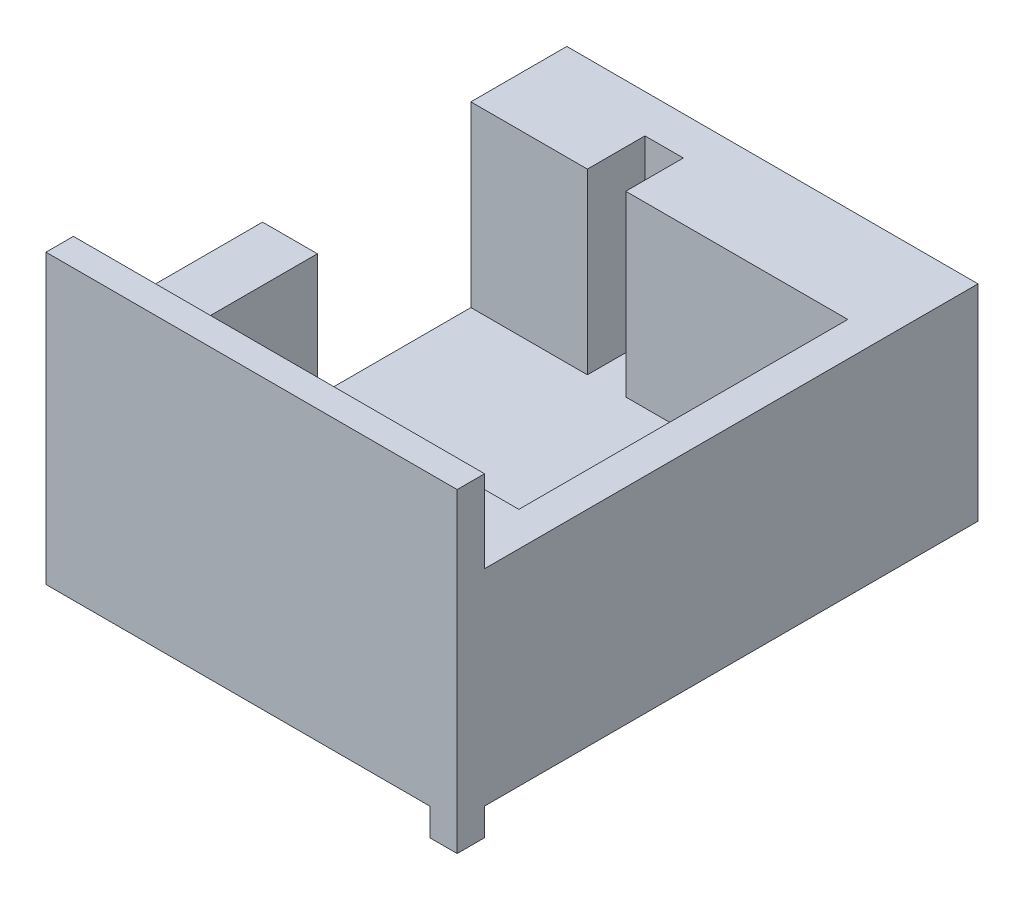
from build123d import *

# Parameters (mm, degrees)
SKETCH_1_W          = 30
SKETCH_1_H          = 38
EXTRUDE_1_DEPTH     = 15
CUT_EXTRUDE_3_DEPTH = 13
CUT_EXTRUDE_5_REACH = 40.549
SKETCH_7_W          = 2
SKETCH_7_H          = 2
EXTRUDE_2_DEPTH     = 2
SKETCH_8_W          = 2
SKETCH_8_H          = 6
EXTRUDE_3_DEPTH     = 30
SKETCH_9_W          = 3
SKETCH_9_H          = 24
CUT_EXTRUDE_6_DEPTH = 10
CUT_EXTRUDE_7_REACH = 43.255
SKETCH_10_W         = 15.2
SKETCH_10_H         = 13


with BuildPart() as part:
    # Sketch 1 → Extrude 1 (new body)
    with BuildSketch(Plane(origin=(0, 0, 0), x_dir=(1, 0, 0), z_dir=(0, 1, 0))):
        Rectangle(SKETCH_1_W, SKETCH_1_H)
    extrude(amount=EXTRUDE_1_DEPTH)

    # Sketch 4 → Cut-Extrude 3 (cut)
    with BuildSketch(Plane(origin=(0, 15, 0), x_dir=(1, 0, 0), z_dir=(0, 1, 0))):
        Polygon((12.5, 12), (12.5, -12), (-3.7, -12), (-3.7, -16.2), (-6.5, -16.2), (-6.5, -12), (-11, -12), (-11, 12), (-6.5, 12), (-6.5, 16.2), (-3.7, 16.2), (-3.7, 12), align=None)
    extrude(amount=-CUT_EXTRUDE_3_DEPTH, mode=Mode.SUBTRACT)

    # Sketch 6 → Cut-Extrude 5 (cut, up to next)
    with BuildSketch(Plane.ZY.offset(15), mode=Mode.PRIVATE) as cut_extrude_5_sk1:
        with BuildLine():
            Line((2.196152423, 8.15), (2.196152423, 15))
            Line((2.196152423, 15), (-12, 15))
            Line((-12, 15), (-12, 8.15))
            ThreePointArc((-12, 8.15), (-7.552914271, 2.354445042), (-0.803847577, 5.15))
            ThreePointArc((-0.803847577, 5.15), (1.317472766, 6.028679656), (2.196152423, 8.15))
        make_face()
    cut_extrude_5_tool1 = extrude(cut_extrude_5_sk1.sketch, amount=-CUT_EXTRUDE_5_REACH, mode=Mode.PRIVATE) & part.part
    add(cut_extrude_5_tool1.solids().sort_by_distance((-15, 9.292442, -5.098725))[0], mode=Mode.SUBTRACT)

    # Sketch 7 → Extrude 2 (add)
    with BuildSketch(Plane.XZ):
        with Locations((14, 18)):
            Rectangle(SKETCH_7_W, SKETCH_7_H)
    extrude(amount=EXTRUDE_2_DEPTH)

    # Sketch 8 → Extrude 3 (add)
    with BuildSketch(Plane(origin=(15, 0, 0), x_dir=(0, 0, -1), z_dir=(1, 0, 0))):
        with Locations((-18, 18)):
            Rectangle(SKETCH_8_W, SKETCH_8_H)
    extrude(amount=-EXTRUDE_3_DEPTH)

    # Sketch 9 → Cut-Extrude 6 (cut)
    with BuildSketch(Plane(origin=(0, 2, 0), x_dir=(1, 0, 0), z_dir=(0, 1, 0))):
        with Locations((11, 0)):
            Rectangle(SKETCH_9_W, SKETCH_9_H)
    extrude(amount=-CUT_EXTRUDE_6_DEPTH, mode=Mode.SUBTRACT)

    # Sketch 10 → Cut-Extrude 7 (cut, up to next)
    with BuildSketch(Plane.ZY.offset(15), mode=Mode.PRIVATE) as cut_extrude_7_sk1:
        with Locations((-4.4, 8.5)):
            Rectangle(SKETCH_10_W, SKETCH_10_H)
    cut_extrude_7_tool1 = extrude(cut_extrude_7_sk1.sketch, amount=-CUT_EXTRUDE_7_REACH, mode=Mode.PRIVATE) & part.part
    add(cut_extrude_7_tool1.solids().sort_by_distance((-15, 8.5, -4.4))[0], mode=Mode.SUBTRACT)


solid = part.part
